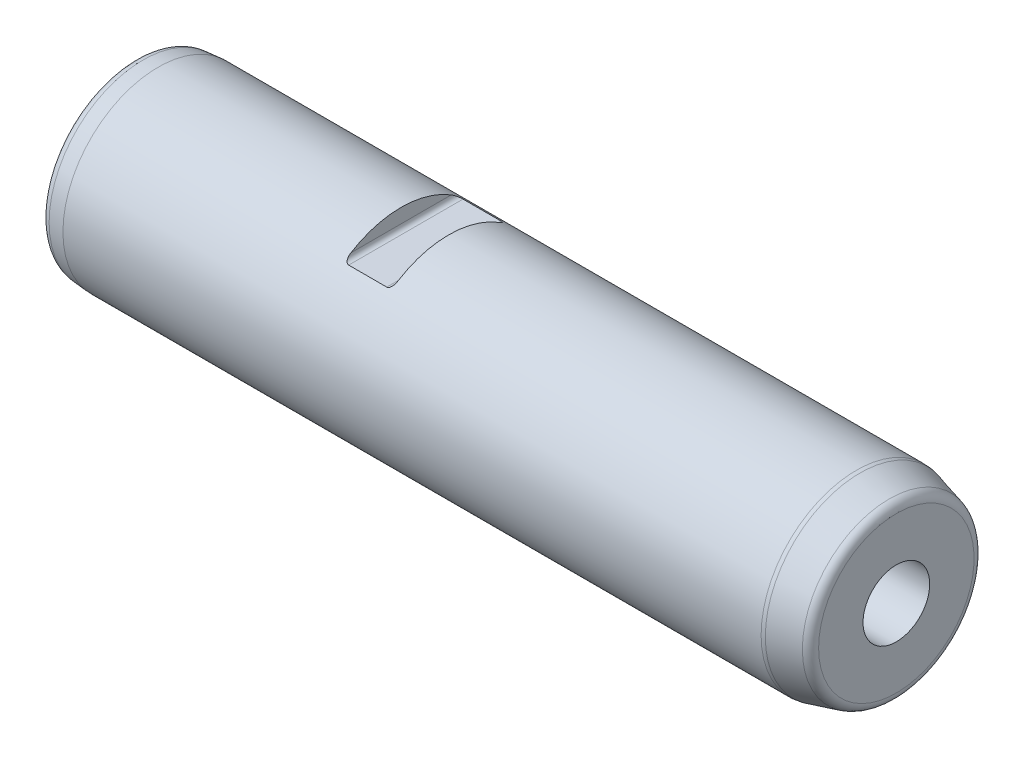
ISO-10303-21;
HEADER;
FILE_DESCRIPTION(('STEP AP214'),'2;1');
FILE_NAME('part.step','',(''),(''),'','','');
FILE_SCHEMA(('AUTOMOTIVE_DESIGN { 1 0 10303 214 1 1 1 1 }'));
ENDSEC;
DATA;
#1=APPLICATION_CONTEXT('core data for automotive mechanical design processes');
#2=APPLICATION_PROTOCOL_DEFINITION('international standard','automotive_design',2000,#1);
#3=PRODUCT_CONTEXT('',#1,'mechanical');
#4=PRODUCT('Part','Part','',(#3));
#5=PRODUCT_RELATED_PRODUCT_CATEGORY('part','',(#4));
#6=PRODUCT_DEFINITION_FORMATION('','',#4);
#7=PRODUCT_DEFINITION_CONTEXT('part definition',#1,'design');
#8=PRODUCT_DEFINITION('design','',#6,#7);
#9=PRODUCT_DEFINITION_SHAPE('','',#8);
#10=(LENGTH_UNIT() NAMED_UNIT(*) SI_UNIT(.MILLI.,.METRE.));
#11=(NAMED_UNIT(*) PLANE_ANGLE_UNIT() SI_UNIT($,.RADIAN.));
#12=(NAMED_UNIT(*) SI_UNIT($,.STERADIAN.) SOLID_ANGLE_UNIT());
#13=UNCERTAINTY_MEASURE_WITH_UNIT(LENGTH_MEASURE(1.E-05),#10,'distance_accuracy_value','');
#14=(GEOMETRIC_REPRESENTATION_CONTEXT(3) GLOBAL_UNCERTAINTY_ASSIGNED_CONTEXT((#13)) GLOBAL_UNIT_ASSIGNED_CONTEXT((#10,
#11,#12)) REPRESENTATION_CONTEXT('',''));
#15=CARTESIAN_POINT('',(0.,0.,0.));
#16=DIRECTION('',(0.,0.,1.));
#17=DIRECTION('',(1.,0.,0.));
#18=AXIS2_PLACEMENT_3D('',#15,#16,#17);
#19=CARTESIAN_POINT('',(0.,0.,0.));
#20=DIRECTION('',(1.,0.,0.));
#21=DIRECTION('',(0.,0.,-1.));
#22=AXIS2_PLACEMENT_3D('',#19,#20,#21);
#23=PLANE('',#22);
#24=CARTESIAN_POINT('',(0.,0.,0.));
#25=DIRECTION('',(1.,0.,0.));
#26=DIRECTION('',(0.,0.,-1.));
#27=AXIS2_PLACEMENT_3D('',#24,#25,#26);
#28=CIRCLE('',#27,17.7298943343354);
#29=CARTESIAN_POINT('',(0.,0.,-17.7298943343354));
#30=VERTEX_POINT('',#29);
#31=EDGE_CURVE('E160',#30,#30,#28,.F.);
#32=ORIENTED_EDGE('',*,*,#31,.T.);
#33=EDGE_LOOP('',(#32));
#34=FACE_BOUND('',#33,.T.);
#35=ADVANCED_FACE('F15',(#34),#23,.F.);
#36=CARTESIAN_POINT('',(0.,0.,0.));
#37=DIRECTION('',(-1.,0.,0.));
#38=DIRECTION('',(0.,0.,1.));
#39=AXIS2_PLACEMENT_3D('',#36,#37,#38);
#40=CYLINDRICAL_SURFACE('',#39,20.);
#41=CARTESIAN_POINT('',(65.,16.,-12.));
#42=CARTESIAN_POINT('',(65.0203975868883,15.9999962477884,-12.0000045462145));
#43=CARTESIAN_POINT('',(65.0407804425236,16.0006247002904,-11.9991670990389));
#44=CARTESIAN_POINT('',(65.0813146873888,16.0031055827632,-11.9958583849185));
#45=CARTESIAN_POINT('',(65.1014663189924,16.004956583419,-11.993389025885));
#46=CARTESIAN_POINT('',(65.1608545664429,16.0122253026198,-11.9836850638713));
#47=CARTESIAN_POINT('',(65.1995323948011,16.0193609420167,-11.9741518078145));
#48=CARTESIAN_POINT('',(65.2739645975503,16.037497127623,-11.9498497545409));
#49=CARTESIAN_POINT('',(65.3097307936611,16.0484809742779,-11.9351035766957));
#50=CARTESIAN_POINT('',(65.3781242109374,16.0735266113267,-11.9013522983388));
#51=CARTESIAN_POINT('',(65.41074138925,16.087597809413,-11.8823341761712));
#52=CARTESIAN_POINT('',(65.4887324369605,16.1259889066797,-11.8302152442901));
#53=CARTESIAN_POINT('',(65.5318948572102,16.1518280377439,-11.7949407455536));
#54=CARTESIAN_POINT('',(65.6109129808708,16.2068340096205,-11.7192462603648));
#55=CARTESIAN_POINT('',(65.6467545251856,16.2360071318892,-11.678816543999));
#56=CARTESIAN_POINT('',(65.7058021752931,16.2906763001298,-11.6023981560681));
#57=CARTESIAN_POINT('',(65.7301168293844,16.3158314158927,-11.567005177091));
#58=CARTESIAN_POINT('',(65.7749157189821,16.3670212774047,-11.4944592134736));
#59=CARTESIAN_POINT('',(65.7953974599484,16.3930565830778,-11.4573051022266));
#60=CARTESIAN_POINT('',(65.8518244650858,16.4721604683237,-11.343563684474));
#61=CARTESIAN_POINT('',(65.8825725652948,16.5260510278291,-11.2649424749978));
#62=CARTESIAN_POINT('',(65.9240070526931,16.6156385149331,-11.1321438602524));
#63=CARTESIAN_POINT('',(65.9379569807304,16.6512330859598,-11.0788360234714));
#64=CARTESIAN_POINT('',(65.9614191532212,16.7223722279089,-10.9711632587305));
#65=CARTESIAN_POINT('',(65.9709289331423,16.7579167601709,-10.9167977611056));
#66=CARTESIAN_POINT('',(65.9857688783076,16.8281581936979,-10.808200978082));
#67=CARTESIAN_POINT('',(65.9911623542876,16.862859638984,-10.7539810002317));
#68=CARTESIAN_POINT('',(65.998268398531,16.9317984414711,-10.6451097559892));
#69=CARTESIAN_POINT('',(65.999986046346,16.9660363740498,-10.5904591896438));
#70=CARTESIAN_POINT('',(66.,17.,-10.5356537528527));
#71=B_SPLINE_CURVE_WITH_KNOTS('',3,(#41,#42,#43,#44,#45,#46,#47,#48,#49,#50,#51,#52,#53,#54,#55,
#56,#57,#58,#59,#60,#61,#62,#63,#64,#65,#66,#67,#68,#69,#70),.UNSPECIFIED.,.F.,.F.,(4,2,2,2,2,2,
2,2,2,2,2,2,2,2,4),(0.,0.0611385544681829,0.122205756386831,0.242843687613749,0.36296445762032,
0.483456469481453,0.666747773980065,0.85039028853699,0.999479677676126,1.14866576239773,
1.44807901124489,1.64475203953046,1.841534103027,2.03522492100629,2.22864790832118),.UNSPECIFIED.);
#72=CARTESIAN_POINT('',(65.,16.,-12.));
#73=VERTEX_POINT('',#72);
#74=CARTESIAN_POINT('',(66.,17.,-10.5356537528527));
#75=VERTEX_POINT('',#74);
#76=EDGE_CURVE('E206',#73,#75,#71,.T.);
#77=ORIENTED_EDGE('',*,*,#76,.T.);
#78=CARTESIAN_POINT('',(66.,0.,0.));
#79=DIRECTION('',(1.,0.,0.));
#80=DIRECTION('',(0.,0.,-1.));
#81=AXIS2_PLACEMENT_3D('',#78,#79,#80);
#82=CIRCLE('',#81,20.);
#83=CARTESIAN_POINT('',(66.,17.,10.5356537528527));
#84=VERTEX_POINT('',#83);
#85=EDGE_CURVE('E9',#75,#84,#82,.T.);
#86=ORIENTED_EDGE('',*,*,#85,.T.);
#87=CARTESIAN_POINT('',(66.,17.,10.5356537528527));
#88=CARTESIAN_POINT('',(65.9999580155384,16.9556282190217,10.6072606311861));
#89=CARTESIAN_POINT('',(65.9970414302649,16.9107662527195,10.6786284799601));
#90=CARTESIAN_POINT('',(65.9847801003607,16.8201915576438,10.8207316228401));
#91=CARTESIAN_POINT('',(65.9754049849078,16.7744758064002,10.8914623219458));
#92=CARTESIAN_POINT('',(65.9494193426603,16.6823378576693,11.0320779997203));
#93=CARTESIAN_POINT('',(65.9327445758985,16.6359130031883,11.1019496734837));
#94=CARTESIAN_POINT('',(65.8911331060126,16.5434346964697,11.2392876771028));
#95=CARTESIAN_POINT('',(65.8662148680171,16.4973806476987,11.3067590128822));
#96=CARTESIAN_POINT('',(65.8154112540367,16.4198497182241,11.4189199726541));
#97=CARTESIAN_POINT('',(65.7919526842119,16.3880587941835,11.4644877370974));
#98=CARTESIAN_POINT('',(65.739534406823,16.3256491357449,11.5531862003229));
#99=CARTESIAN_POINT('',(65.7105793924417,16.2950294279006,11.5963189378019));
#100=CARTESIAN_POINT('',(65.6461040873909,16.2354774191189,11.6795510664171));
#101=CARTESIAN_POINT('',(65.610528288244,16.2065623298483,11.7196204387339));
#102=CARTESIAN_POINT('',(65.5321445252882,16.1520057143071,11.7946959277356));
#103=CARTESIAN_POINT('',(65.489347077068,16.1263595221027,11.829709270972));
#104=CARTESIAN_POINT('',(65.4114116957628,16.0878834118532,11.8819483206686));
#105=CARTESIAN_POINT('',(65.3783803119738,16.0736117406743,11.9012377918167));
#106=CARTESIAN_POINT('',(65.3090792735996,16.048251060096,11.9354131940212));
#107=CARTESIAN_POINT('',(65.2728207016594,16.0371516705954,11.9503134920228));
#108=CARTESIAN_POINT('',(65.1981046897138,16.0190813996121,11.9745255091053));
#109=CARTESIAN_POINT('',(65.1596911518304,16.0120479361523,11.9839219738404));
#110=CARTESIAN_POINT('',(65.10072428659,16.0048841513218,11.9934856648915));
#111=CARTESIAN_POINT('',(65.0807179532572,16.0030600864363,11.9959190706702));
#112=CARTESIAN_POINT('',(65.040479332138,16.0006154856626,11.9991793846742));
#113=CARTESIAN_POINT('',(65.0202468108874,15.9999963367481,12.0000044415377));
#114=CARTESIAN_POINT('',(65.,16.,12.));
#115=B_SPLINE_CURVE_WITH_KNOTS('',3,(#87,#88,#89,#90,#91,#92,#93,#94,#95,#96,#97,#98,#99,#100,
#101,#102,#103,#104,#105,#106,#107,#108,#109,#110,#111,#112,#113,#114),.UNSPECIFIED.,.F.,.F.,(4,
2,2,2,2,2,2,2,2,2,2,2,2,4),(0.,0.252754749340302,0.506706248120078,0.762939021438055,
1.01860168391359,1.19928577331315,1.3798162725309,1.56193473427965,1.74379026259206,
1.86586776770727,1.98754112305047,2.10728809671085,2.16790599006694,2.22859361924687),.UNSPECIFIED.);
#116=CARTESIAN_POINT('',(65.,16.,12.));
#117=VERTEX_POINT('',#116);
#118=EDGE_CURVE('E23',#84,#117,#115,.T.);
#119=ORIENTED_EDGE('',*,*,#118,.T.);
#120=DIRECTION('',(-1.,0.,0.));
#121=VECTOR('',#120,1.);
#122=CARTESIAN_POINT('',(0.,16.,12.));
#123=LINE('',#122,#121);
#124=CARTESIAN_POINT('',(57.,16.,12.));
#125=VERTEX_POINT('',#124);
#126=EDGE_CURVE('E74',#117,#125,#123,.T.);
#127=ORIENTED_EDGE('',*,*,#126,.T.);
#128=CARTESIAN_POINT('',(57.,16.,12.));
#129=CARTESIAN_POINT('',(56.9796024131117,15.9999962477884,12.0000045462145));
#130=CARTESIAN_POINT('',(56.9592195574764,16.0006247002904,11.9991670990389));
#131=CARTESIAN_POINT('',(56.9186853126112,16.0031055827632,11.9958583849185));
#132=CARTESIAN_POINT('',(56.8985336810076,16.004956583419,11.993389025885));
#133=CARTESIAN_POINT('',(56.839145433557,16.0122253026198,11.9836850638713));
#134=CARTESIAN_POINT('',(56.8004676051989,16.0193609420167,11.9741518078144));
#135=CARTESIAN_POINT('',(56.7260354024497,16.037497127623,11.9498497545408));
#136=CARTESIAN_POINT('',(56.6902692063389,16.0484809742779,11.9351035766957));
#137=CARTESIAN_POINT('',(56.6218757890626,16.0735266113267,11.9013522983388));
#138=CARTESIAN_POINT('',(56.58925861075,16.087597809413,11.8823341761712));
#139=CARTESIAN_POINT('',(56.5112675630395,16.1259889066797,11.8302152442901));
#140=CARTESIAN_POINT('',(56.4681051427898,16.1518280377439,11.7949407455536));
#141=CARTESIAN_POINT('',(56.3890870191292,16.2068340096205,11.7192462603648));
#142=CARTESIAN_POINT('',(56.3532454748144,16.2360071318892,11.678816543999));
#143=CARTESIAN_POINT('',(56.2941978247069,16.2906763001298,11.6023981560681));
#144=CARTESIAN_POINT('',(56.2698831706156,16.3158314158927,11.567005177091));
#145=CARTESIAN_POINT('',(56.2250842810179,16.3670212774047,11.4944592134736));
#146=CARTESIAN_POINT('',(56.2046025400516,16.3930565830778,11.4573051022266));
#147=CARTESIAN_POINT('',(56.1481755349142,16.4721604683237,11.343563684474));
#148=CARTESIAN_POINT('',(56.1174274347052,16.5260510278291,11.2649424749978));
#149=CARTESIAN_POINT('',(56.0759929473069,16.6156385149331,11.1321438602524));
#150=CARTESIAN_POINT('',(56.0620430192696,16.6512330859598,11.0788360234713));
#151=CARTESIAN_POINT('',(56.0385808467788,16.7223722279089,10.9711632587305));
#152=CARTESIAN_POINT('',(56.0290710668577,16.7579167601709,10.9167977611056));
#153=CARTESIAN_POINT('',(56.0142311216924,16.8281581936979,10.808200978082));
#154=CARTESIAN_POINT('',(56.0088376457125,16.862859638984,10.7539810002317));
#155=CARTESIAN_POINT('',(56.001731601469,16.9317984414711,10.6451097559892));
#156=CARTESIAN_POINT('',(56.000013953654,16.9660363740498,10.5904591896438));
#157=CARTESIAN_POINT('',(56.,17.,10.5356537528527));
#158=B_SPLINE_CURVE_WITH_KNOTS('',3,(#128,#129,#130,#131,#132,#133,#134,#135,#136,#137,#138,
#139,#140,#141,#142,#143,#144,#145,#146,#147,#148,#149,#150,#151,#152,#153,#154,#155,#156,#157),
.UNSPECIFIED.,.F.,.F.,(4,2,2,2,2,2,2,2,2,2,2,2,2,2,4),(0.,0.0611385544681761,0.122205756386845,
0.24284368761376,0.362964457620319,0.483456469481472,0.666747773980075,0.850390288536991,
0.999479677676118,1.14866576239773,1.44807901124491,1.64475203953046,1.841534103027,
2.03522492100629,2.22864790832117),.UNSPECIFIED.);
#159=CARTESIAN_POINT('',(56.,17.,10.5356537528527));
#160=VERTEX_POINT('',#159);
#161=EDGE_CURVE('E65',#125,#160,#158,.T.);
#162=ORIENTED_EDGE('',*,*,#161,.T.);
#163=CARTESIAN_POINT('',(56.,0.,0.));
#164=DIRECTION('',(-1.,0.,0.));
#165=DIRECTION('',(0.,0.,1.));
#166=AXIS2_PLACEMENT_3D('',#163,#164,#165);
#167=CIRCLE('',#166,20.);
#168=CARTESIAN_POINT('',(56.,17.,-10.5356537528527));
#169=VERTEX_POINT('',#168);
#170=EDGE_CURVE('E54',#160,#169,#167,.T.);
#171=ORIENTED_EDGE('',*,*,#170,.T.);
#172=CARTESIAN_POINT('',(56.,17.,-10.5356537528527));
#173=CARTESIAN_POINT('',(56.0000419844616,16.9556282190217,-10.6072606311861));
#174=CARTESIAN_POINT('',(56.0029585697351,16.9107662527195,-10.6786284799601));
#175=CARTESIAN_POINT('',(56.0152198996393,16.8201915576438,-10.8207316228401));
#176=CARTESIAN_POINT('',(56.0245950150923,16.7744758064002,-10.8914623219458));
#177=CARTESIAN_POINT('',(56.0505806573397,16.6823378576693,-11.0320779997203));
#178=CARTESIAN_POINT('',(56.0672554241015,16.6359130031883,-11.1019496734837));
#179=CARTESIAN_POINT('',(56.1088668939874,16.5434346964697,-11.2392876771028));
#180=CARTESIAN_POINT('',(56.1337851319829,16.4973806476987,-11.3067590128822));
#181=CARTESIAN_POINT('',(56.1845887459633,16.4198497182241,-11.4189199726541));
#182=CARTESIAN_POINT('',(56.2080473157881,16.3880587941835,-11.4644877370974));
#183=CARTESIAN_POINT('',(56.260465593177,16.3256491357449,-11.5531862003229));
#184=CARTESIAN_POINT('',(56.2894206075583,16.2950294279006,-11.5963189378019));
#185=CARTESIAN_POINT('',(56.3538959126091,16.2354774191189,-11.6795510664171));
#186=CARTESIAN_POINT('',(56.389471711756,16.2065623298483,-11.7196204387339));
#187=CARTESIAN_POINT('',(56.4678554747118,16.1520057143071,-11.7946959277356));
#188=CARTESIAN_POINT('',(56.510652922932,16.1263595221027,-11.829709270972));
#189=CARTESIAN_POINT('',(56.5885883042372,16.0878834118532,-11.8819483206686));
#190=CARTESIAN_POINT('',(56.6216196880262,16.0736117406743,-11.9012377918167));
#191=CARTESIAN_POINT('',(56.6909207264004,16.048251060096,-11.9354131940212));
#192=CARTESIAN_POINT('',(56.7271792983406,16.0371516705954,-11.9503134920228));
#193=CARTESIAN_POINT('',(56.8018953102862,16.0190813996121,-11.9745255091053));
#194=CARTESIAN_POINT('',(56.8403088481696,16.0120479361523,-11.9839219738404));
#195=CARTESIAN_POINT('',(56.89927571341,16.0048841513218,-11.9934856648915));
#196=CARTESIAN_POINT('',(56.9192820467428,16.0030600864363,-11.9959190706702));
#197=CARTESIAN_POINT('',(56.959520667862,16.0006154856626,-11.9991793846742));
#198=CARTESIAN_POINT('',(56.9797531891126,15.9999963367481,-12.0000044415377));
#199=CARTESIAN_POINT('',(57.,16.,-12.));
#200=B_SPLINE_CURVE_WITH_KNOTS('',3,(#172,#173,#174,#175,#176,#177,#178,#179,#180,#181,#182,
#183,#184,#185,#186,#187,#188,#189,#190,#191,#192,#193,#194,#195,#196,#197,#198,#199),
.UNSPECIFIED.,.F.,.F.,(4,2,2,2,2,2,2,2,2,2,2,2,2,4),(0.,0.252754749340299,0.506706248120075,
0.762939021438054,1.01860168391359,1.19928577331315,1.3798162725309,1.56193473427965,
1.74379026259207,1.86586776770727,1.98754112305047,2.10728809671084,2.16790599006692,
2.22859361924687),.UNSPECIFIED.);
#201=CARTESIAN_POINT('',(57.,16.,-12.));
#202=VERTEX_POINT('',#201);
#203=EDGE_CURVE('E59',#169,#202,#200,.T.);
#204=ORIENTED_EDGE('',*,*,#203,.T.);
#205=DIRECTION('',(-1.,0.,0.));
#206=VECTOR('',#205,1.);
#207=CARTESIAN_POINT('',(0.,16.,-12.));
#208=LINE('',#207,#206);
#209=EDGE_CURVE('E75',#202,#73,#208,.F.);
#210=ORIENTED_EDGE('',*,*,#209,.T.);
#211=EDGE_LOOP('',(#77,#86,#119,#127,#162,#171,#204,#210));
#212=FACE_BOUND('',#211,.T.);
#213=CARTESIAN_POINT('',(5.00000000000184,0.,0.));
#214=DIRECTION('',(1.,0.,0.));
#215=DIRECTION('',(0.,0.,-1.));
#216=AXIS2_PLACEMENT_3D('',#213,#214,#215);
#217=CIRCLE('',#216,20.);
#218=CARTESIAN_POINT('',(5.00000000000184,0.,-20.));
#219=VERTEX_POINT('',#218);
#220=EDGE_CURVE('E159',#219,#219,#217,.T.);
#221=ORIENTED_EDGE('',*,*,#220,.T.);
#222=EDGE_LOOP('',(#221));
#223=FACE_BOUND('',#222,.T.);
#224=CARTESIAN_POINT('',(151.605042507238,0.,0.));
#225=DIRECTION('',(1.,0.,0.));
#226=DIRECTION('',(0.,0.,-1.));
#227=AXIS2_PLACEMENT_3D('',#224,#225,#226);
#228=CIRCLE('',#227,20.);
#229=CARTESIAN_POINT('',(151.605042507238,0.,-20.));
#230=VERTEX_POINT('',#229);
#231=EDGE_CURVE('E177',#230,#230,#228,.F.);
#232=ORIENTED_EDGE('',*,*,#231,.T.);
#233=EDGE_LOOP('',(#232));
#234=FACE_BOUND('',#233,.T.);
#235=ADVANCED_FACE('F71',(#212,#223,#234),#40,.T.);
#236=CARTESIAN_POINT('',(160.,0.,0.));
#237=DIRECTION('',(-1.,0.,0.));
#238=DIRECTION('',(0.,0.,1.));
#239=AXIS2_PLACEMENT_3D('',#236,#237,#238);
#240=CONICAL_SURFACE('',#239,17.856406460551,0.26179938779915);
#241=CARTESIAN_POINT('',(158.517638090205,0.,0.));
#242=DIRECTION('',(1.,0.,0.));
#243=DIRECTION('',(0.,0.,-1.));
#244=AXIS2_PLACEMENT_3D('',#241,#242,#243);
#245=CIRCLE('',#244,18.2536041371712);
#246=CARTESIAN_POINT('',(158.517638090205,0.,-18.2536041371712));
#247=VERTEX_POINT('',#246);
#248=EDGE_CURVE('E165',#247,#247,#245,.F.);
#249=ORIENTED_EDGE('',*,*,#248,.T.);
#250=EDGE_LOOP('',(#249));
#251=FACE_BOUND('',#250,.T.);
#252=CARTESIAN_POINT('',(152.381499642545,0.,0.));
#253=DIRECTION('',(1.,0.,0.));
#254=DIRECTION('',(0.,0.,-1.));
#255=AXIS2_PLACEMENT_3D('',#252,#253,#254);
#256=CIRCLE('',#255,19.8977774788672);
#257=CARTESIAN_POINT('',(152.381499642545,0.,-19.8977774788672));
#258=VERTEX_POINT('',#257);
#259=EDGE_CURVE('E190',#258,#258,#256,.T.);
#260=ORIENTED_EDGE('',*,*,#259,.T.);
#261=EDGE_LOOP('',(#260));
#262=FACE_BOUND('',#261,.T.);
#263=ADVANCED_FACE('F122',(#251,#262),#240,.T.);
#264=CARTESIAN_POINT('',(160.,17.856406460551,0.));
#265=DIRECTION('',(-1.,0.,0.));
#266=DIRECTION('',(0.,0.,1.));
#267=AXIS2_PLACEMENT_3D('',#264,#265,#266);
#268=PLANE('',#267);
#269=CARTESIAN_POINT('',(160.,0.,0.));
#270=DIRECTION('',(1.,0.,0.));
#271=DIRECTION('',(0.,0.,-1.));
#272=AXIS2_PLACEMENT_3D('',#269,#270,#271);
#273=CIRCLE('',#272,7.);
#274=CARTESIAN_POINT('',(160.,0.,-7.));
#275=VERTEX_POINT('',#274);
#276=EDGE_CURVE('E180',#275,#275,#273,.T.);
#277=ORIENTED_EDGE('',*,*,#276,.F.);
#278=EDGE_LOOP('',(#277));
#279=FACE_BOUND('',#278,.T.);
#280=CARTESIAN_POINT('',(160.,0.,0.));
#281=DIRECTION('',(-1.,0.,0.));
#282=DIRECTION('',(0.,0.,1.));
#283=AXIS2_PLACEMENT_3D('',#280,#281,#282);
#284=CIRCLE('',#283,16.3217524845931);
#285=CARTESIAN_POINT('',(160.,0.,16.3217524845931));
#286=VERTEX_POINT('',#285);
#287=EDGE_CURVE('E161',#286,#286,#284,.F.);
#288=ORIENTED_EDGE('',*,*,#287,.T.);
#289=EDGE_LOOP('',(#288));
#290=FACE_BOUND('',#289,.T.);
#291=ADVANCED_FACE('F119',(#279,#290),#268,.F.);
#292=CARTESIAN_POINT('',(151.605042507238,0.,0.));
#293=DIRECTION('',(1.,0.,0.));
#294=DIRECTION('',(0.,0.,-1.));
#295=AXIS2_PLACEMENT_3D('',#292,#293,#294);
#296=TOROIDAL_SURFACE('',#295,17.,3.);
#297=ORIENTED_EDGE('',*,*,#259,.F.);
#298=EDGE_LOOP('',(#297));
#299=FACE_BOUND('',#298,.T.);
#300=ORIENTED_EDGE('',*,*,#231,.F.);
#301=EDGE_LOOP('',(#300));
#302=FACE_BOUND('',#301,.T.);
#303=ADVANCED_FACE('F121',(#299,#302),#296,.T.);
#304=CARTESIAN_POINT('',(158.,0.,0.));
#305=DIRECTION('',(-1.,0.,0.));
#306=DIRECTION('',(0.,0.,1.));
#307=AXIS2_PLACEMENT_3D('',#304,#305,#306);
#308=TOROIDAL_SURFACE('',#307,16.3217524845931,2.);
#309=ORIENTED_EDGE('',*,*,#287,.F.);
#310=EDGE_LOOP('',(#309));
#311=FACE_BOUND('',#310,.T.);
#312=ORIENTED_EDGE('',*,*,#248,.F.);
#313=EDGE_LOOP('',(#312));
#314=FACE_BOUND('',#313,.T.);
#315=ADVANCED_FACE('F142',(#311,#314),#308,.T.);
#316=CARTESIAN_POINT('',(0.,0.,0.));
#317=DIRECTION('',(1.,0.,0.));
#318=DIRECTION('',(0.,0.,-1.));
#319=AXIS2_PLACEMENT_3D('',#316,#317,#318);
#320=CONICAL_SURFACE('',#319,19.5625566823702,0.0872664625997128);
#321=CARTESIAN_POINT('',(1.82568851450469,0.,0.));
#322=DIRECTION('',(1.,0.,0.));
#323=DIRECTION('',(0.,0.,-1.));
#324=AXIS2_PLACEMENT_3D('',#321,#322,#323);
#325=CIRCLE('',#324,19.7222837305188);
#326=CARTESIAN_POINT('',(1.82568851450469,0.,-19.7222837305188));
#327=VERTEX_POINT('',#326);
#328=EDGE_CURVE('E60',#327,#327,#325,.T.);
#329=ORIENTED_EDGE('',*,*,#328,.T.);
#330=EDGE_LOOP('',(#329));
#331=FACE_BOUND('',#330,.T.);
#332=ORIENTED_EDGE('',*,*,#220,.F.);
#333=EDGE_LOOP('',(#332));
#334=FACE_BOUND('',#333,.T.);
#335=ADVANCED_FACE('F145',(#331,#334),#320,.T.);
#336=CARTESIAN_POINT('',(2.,0.,0.));
#337=DIRECTION('',(1.,0.,0.));
#338=DIRECTION('',(0.,0.,-1.));
#339=AXIS2_PLACEMENT_3D('',#336,#337,#338);
#340=TOROIDAL_SURFACE('',#339,17.7298943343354,2.);
#341=ORIENTED_EDGE('',*,*,#328,.F.);
#342=EDGE_LOOP('',(#341));
#343=FACE_BOUND('',#342,.T.);
#344=ORIENTED_EDGE('',*,*,#31,.F.);
#345=EDGE_LOOP('',(#344));
#346=FACE_BOUND('',#345,.T.);
#347=ADVANCED_FACE('F17',(#343,#346),#340,.T.);
#348=CARTESIAN_POINT('',(136.,0.,0.));
#349=DIRECTION('',(1.,0.,0.));
#350=DIRECTION('',(0.,0.,-1.));
#351=AXIS2_PLACEMENT_3D('',#348,#349,#350);
#352=PLANE('',#351);
#353=CARTESIAN_POINT('',(136.,0.,0.));
#354=DIRECTION('',(1.,0.,0.));
#355=DIRECTION('',(0.,0.,-1.));
#356=AXIS2_PLACEMENT_3D('',#353,#354,#355);
#357=CIRCLE('',#356,7.);
#358=CARTESIAN_POINT('',(136.,0.,-7.));
#359=VERTEX_POINT('',#358);
#360=EDGE_CURVE('E173',#359,#359,#357,.T.);
#361=ORIENTED_EDGE('',*,*,#360,.T.);
#362=EDGE_LOOP('',(#361));
#363=FACE_BOUND('',#362,.T.);
#364=CARTESIAN_POINT('',(136.,0.,0.));
#365=DIRECTION('',(1.,0.,0.));
#366=DIRECTION('',(0.,0.,-1.));
#367=AXIS2_PLACEMENT_3D('',#364,#365,#366);
#368=CIRCLE('',#367,5.1);
#369=CARTESIAN_POINT('',(136.,0.,-5.1));
#370=VERTEX_POINT('',#369);
#371=EDGE_CURVE('E170',#370,#370,#368,.F.);
#372=ORIENTED_EDGE('',*,*,#371,.T.);
#373=EDGE_LOOP('',(#372));
#374=FACE_BOUND('',#373,.T.);
#375=ADVANCED_FACE('F103',(#363,#374),#352,.T.);
#376=CARTESIAN_POINT('',(136.,0.,0.));
#377=DIRECTION('',(1.,0.,0.));
#378=DIRECTION('',(0.,0.,-1.));
#379=AXIS2_PLACEMENT_3D('',#376,#377,#378);
#380=CYLINDRICAL_SURFACE('',#379,7.);
#381=ORIENTED_EDGE('',*,*,#360,.F.);
#382=EDGE_LOOP('',(#381));
#383=FACE_BOUND('',#382,.T.);
#384=ORIENTED_EDGE('',*,*,#276,.T.);
#385=EDGE_LOOP('',(#384));
#386=FACE_BOUND('',#385,.T.);
#387=ADVANCED_FACE('F106',(#383,#386),#380,.F.);
#388=CARTESIAN_POINT('',(130.,0.,0.));
#389=DIRECTION('',(1.,0.,0.));
#390=DIRECTION('',(0.,0.,-1.));
#391=AXIS2_PLACEMENT_3D('',#388,#389,#390);
#392=CONICAL_SURFACE('',#391,5.1,1.0471975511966);
#393=CARTESIAN_POINT('',(127.055513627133,0.,0.));
#394=VERTEX_POINT('',#393);
#395=VERTEX_LOOP('',#394);
#396=FACE_BOUND('',#395,.T.);
#397=CARTESIAN_POINT('',(130.,0.,0.));
#398=DIRECTION('',(1.,0.,0.));
#399=DIRECTION('',(0.,0.,-1.));
#400=AXIS2_PLACEMENT_3D('',#397,#398,#399);
#401=CIRCLE('',#400,5.1);
#402=CARTESIAN_POINT('',(130.,0.,-5.1));
#403=VERTEX_POINT('',#402);
#404=EDGE_CURVE('E172',#403,#403,#401,.T.);
#405=ORIENTED_EDGE('',*,*,#404,.T.);
#406=EDGE_LOOP('',(#405));
#407=FACE_BOUND('',#406,.T.);
#408=ADVANCED_FACE('F110',(#396,#407),#392,.F.);
#409=CARTESIAN_POINT('',(160.,0.,0.));
#410=DIRECTION('',(1.,0.,0.));
#411=DIRECTION('',(0.,0.,-1.));
#412=AXIS2_PLACEMENT_3D('',#409,#410,#411);
#413=CYLINDRICAL_SURFACE('',#412,5.1);
#414=ORIENTED_EDGE('',*,*,#404,.F.);
#415=EDGE_LOOP('',(#414));
#416=FACE_BOUND('',#415,.T.);
#417=ORIENTED_EDGE('',*,*,#371,.F.);
#418=EDGE_LOOP('',(#417));
#419=FACE_BOUND('',#418,.T.);
#420=ADVANCED_FACE('F112',(#416,#419),#413,.F.);
#421=CARTESIAN_POINT('',(66.,17.,-20.));
#422=DIRECTION('',(1.,0.,0.));
#423=DIRECTION('',(0.,0.,-1.));
#424=AXIS2_PLACEMENT_3D('',#421,#422,#423);
#425=PLANE('',#424);
#426=DIRECTION('',(0.,0.,1.));
#427=VECTOR('',#426,1.);
#428=CARTESIAN_POINT('',(66.,17.,-20.));
#429=LINE('',#428,#427);
#430=EDGE_CURVE('E184',#75,#84,#429,.T.);
#431=ORIENTED_EDGE('',*,*,#430,.T.);
#432=ORIENTED_EDGE('',*,*,#85,.F.);
#433=EDGE_LOOP('',(#431,#432));
#434=FACE_BOUND('',#433,.T.);
#435=ADVANCED_FACE('F115',(#434),#425,.F.);
#436=CARTESIAN_POINT('',(65.,17.,-20.));
#437=DIRECTION('',(0.,0.,1.));
#438=DIRECTION('',(1.,0.,0.));
#439=AXIS2_PLACEMENT_3D('',#436,#437,#438);
#440=CYLINDRICAL_SURFACE('',#439,1.);
#441=ORIENTED_EDGE('',*,*,#430,.F.);
#442=ORIENTED_EDGE('',*,*,#76,.F.);
#443=DIRECTION('',(0.,0.,1.));
#444=VECTOR('',#443,1.);
#445=CARTESIAN_POINT('',(65.,16.,-20.));
#446=LINE('',#445,#444);
#447=EDGE_CURVE('E199',#73,#117,#446,.T.);
#448=ORIENTED_EDGE('',*,*,#447,.T.);
#449=ORIENTED_EDGE('',*,*,#118,.F.);
#450=EDGE_LOOP('',(#441,#442,#448,#449));
#451=FACE_BOUND('',#450,.T.);
#452=ADVANCED_FACE('F217',(#451),#440,.F.);
#453=CARTESIAN_POINT('',(57.,16.,-20.));
#454=DIRECTION('',(0.,-1.,0.));
#455=DIRECTION('',(0.,0.,-1.));
#456=AXIS2_PLACEMENT_3D('',#453,#454,#455);
#457=PLANE('',#456);
#458=ORIENTED_EDGE('',*,*,#447,.F.);
#459=ORIENTED_EDGE('',*,*,#209,.F.);
#460=DIRECTION('',(0.,0.,1.));
#461=VECTOR('',#460,1.);
#462=CARTESIAN_POINT('',(57.,16.,-20.));
#463=LINE('',#462,#461);
#464=EDGE_CURVE('E67',#202,#125,#463,.T.);
#465=ORIENTED_EDGE('',*,*,#464,.T.);
#466=ORIENTED_EDGE('',*,*,#126,.F.);
#467=EDGE_LOOP('',(#458,#459,#465,#466));
#468=FACE_BOUND('',#467,.T.);
#469=ADVANCED_FACE('F98',(#468),#457,.F.);
#470=CARTESIAN_POINT('',(57.,17.,-20.));
#471=DIRECTION('',(0.,0.,1.));
#472=DIRECTION('',(1.,0.,0.));
#473=AXIS2_PLACEMENT_3D('',#470,#471,#472);
#474=CYLINDRICAL_SURFACE('',#473,1.);
#475=ORIENTED_EDGE('',*,*,#464,.F.);
#476=ORIENTED_EDGE('',*,*,#203,.F.);
#477=DIRECTION('',(0.,0.,1.));
#478=VECTOR('',#477,1.);
#479=CARTESIAN_POINT('',(56.,17.,-20.));
#480=LINE('',#479,#478);
#481=EDGE_CURVE('E29',#169,#160,#480,.T.);
#482=ORIENTED_EDGE('',*,*,#481,.T.);
#483=ORIENTED_EDGE('',*,*,#161,.F.);
#484=EDGE_LOOP('',(#475,#476,#482,#483));
#485=FACE_BOUND('',#484,.T.);
#486=ADVANCED_FACE('F64',(#485),#474,.F.);
#487=CARTESIAN_POINT('',(56.,20.,-20.));
#488=DIRECTION('',(-1.,0.,0.));
#489=DIRECTION('',(0.,0.,1.));
#490=AXIS2_PLACEMENT_3D('',#487,#488,#489);
#491=PLANE('',#490);
#492=ORIENTED_EDGE('',*,*,#481,.F.);
#493=ORIENTED_EDGE('',*,*,#170,.F.);
#494=EDGE_LOOP('',(#492,#493));
#495=FACE_BOUND('',#494,.T.);
#496=ADVANCED_FACE('F55',(#495),#491,.F.);
#497=CLOSED_SHELL('',(#35,#235,#263,#291,#303,#315,#335,#347,#375,#387,#408,#420,#435,#452,#469,
#486,#496));
#498=MANIFOLD_SOLID_BREP('B1',#497);
#499=ADVANCED_BREP_SHAPE_REPRESENTATION('',(#18,#498),#14);
#500=SHAPE_DEFINITION_REPRESENTATION(#9,#499);
ENDSEC;
END-ISO-10303-21;
